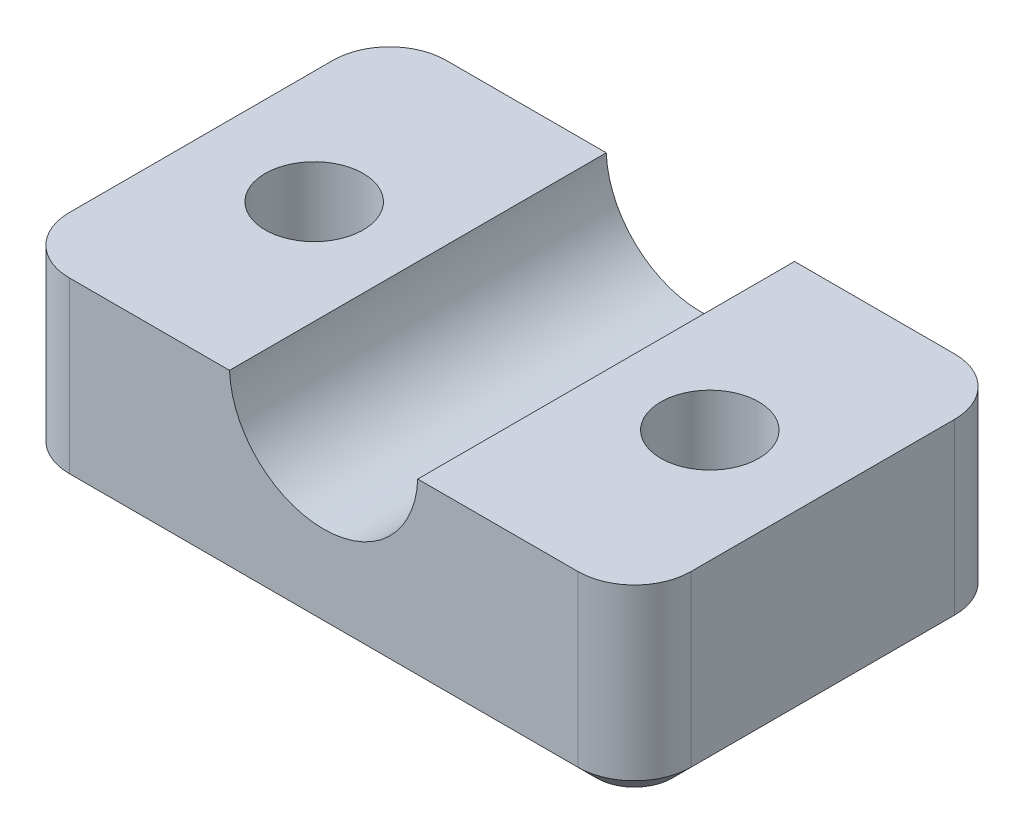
from build123d import *

# Parameters (mm, degrees)
SKETCH1_R           = 2.6
BOSS_EXTRUDE3_DEPTH = 10
SKETCH5_R           = 5
CUT_EXTRUDE3_DEPTH  = 20
CHAMFER1_SIZE       = 1


with BuildPart() as part:
    # Sketch1 → Boss-Extrude3 (new body)
    with BuildSketch(Plane(origin=(0, 0, 0), x_dir=(1, 0, 0), z_dir=(0, 1, 0))):
        with BuildLine():
            Line((-13.5, -10), (13.5, -10))
            ThreePointArc((13.5, -10), (15.621320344, -9.121320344), (16.5, -7))
            Line((16.5, -7), (16.5, 7))
            ThreePointArc((16.5, 7), (15.621320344, 9.121320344), (13.5, 10))
            Line((13.5, 10), (-13.5, 10))
            ThreePointArc((-13.5, 10), (-15.621320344, 9.121320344), (-16.5, 7))
            Line((-16.5, 7), (-16.5, -7))
            ThreePointArc((-16.5, -7), (-15.621320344, -9.121320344), (-13.5, -10))
        make_face()
        with Locations(Location((10.5, 0, 0), (0, 0, 270))):
            Circle(SKETCH1_R, mode=Mode.SUBTRACT)
        with Locations(Location((-10.5, 0, 0), (0, 0, 90))):
            Circle(SKETCH1_R, mode=Mode.SUBTRACT)
    extrude(amount=BOSS_EXTRUDE3_DEPTH)

    # Sketch5 → Cut-Extrude3 (cut)
    with BuildSketch(Plane(origin=(0, 0, -10), x_dir=(-1, 0, 0), z_dir=(0, 0, -1))):
        with Locations((0, 10.2)):
            Circle(SKETCH5_R)
    extrude(amount=-CUT_EXTRUDE3_DEPTH, mode=Mode.SUBTRACT)

    # Chamfer1
    chamfer1_edges = [part.edges().sort_by_distance(p)[0] for p in [
        (0, 0, 10),
        (-15.621320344, 0, 9.121320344),
        (-16.5, 0, 0),
        (-15.621320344, 0, -9.121320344),
        (0, 0, -10),
        (15.621320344, 0, -9.121320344),
        (16.5, 0, 0),
        (15.621320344, 0, 9.121320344),
    ]]
    chamfer(chamfer1_edges, length=CHAMFER1_SIZE)


solid = part.part
